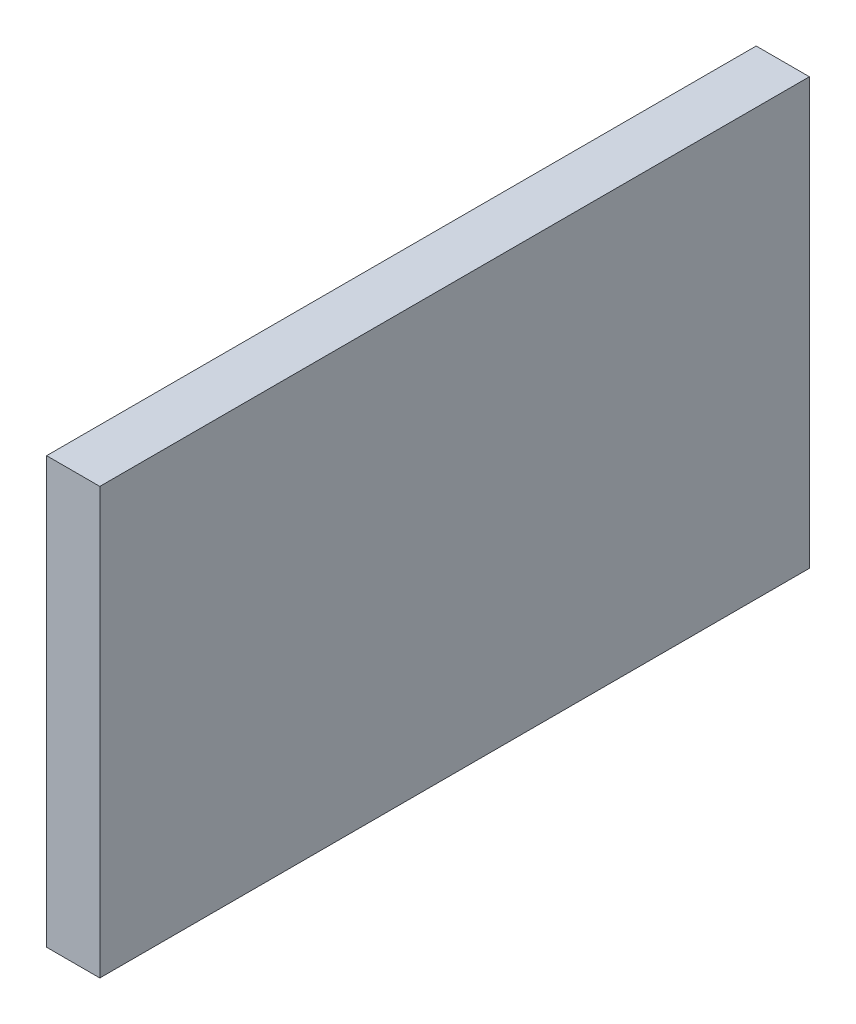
from build123d import *

# Parameters (mm, degrees)
ESQUISSE1_W        = 400
ESQUISSE1_H        = 240
BOSS_EXTRU_1_DEPTH = 15


with BuildPart() as part:
    # Esquisse1 → Boss.-Extru.1 (new, symmetric)
    with BuildSketch(Plane(origin=(0, 0, 0), x_dir=(0, 0, -1), z_dir=(1, 0, 0))):
        Rectangle(ESQUISSE1_W, ESQUISSE1_H)
    extrude(amount=BOSS_EXTRU_1_DEPTH, both=True)


solid = part.part
